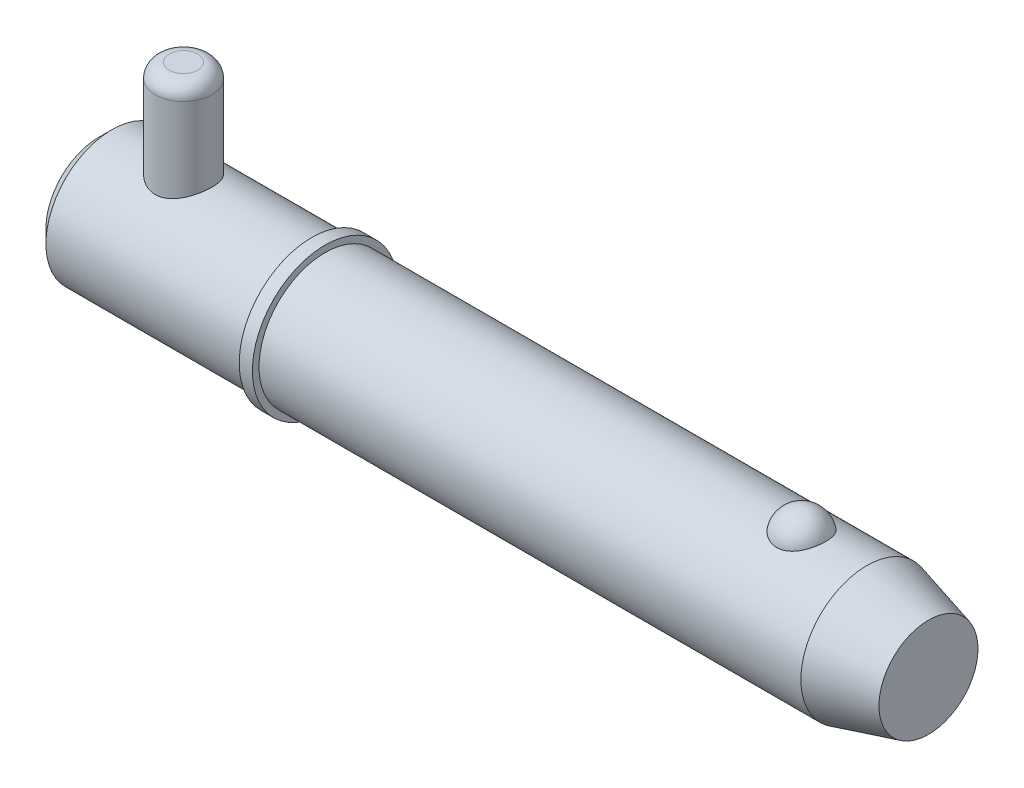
ISO-10303-21;
HEADER;
FILE_DESCRIPTION(('STEP AP214'),'2;1');
FILE_NAME('part.step','',(''),(''),'','','');
FILE_SCHEMA(('AUTOMOTIVE_DESIGN { 1 0 10303 214 1 1 1 1 }'));
ENDSEC;
DATA;
#1=APPLICATION_CONTEXT('core data for automotive mechanical design processes');
#2=APPLICATION_PROTOCOL_DEFINITION('international standard','automotive_design',2000,#1);
#3=PRODUCT_CONTEXT('',#1,'mechanical');
#4=PRODUCT('Part','Part','',(#3));
#5=PRODUCT_RELATED_PRODUCT_CATEGORY('part','',(#4));
#6=PRODUCT_DEFINITION_FORMATION('','',#4);
#7=PRODUCT_DEFINITION_CONTEXT('part definition',#1,'design');
#8=PRODUCT_DEFINITION('design','',#6,#7);
#9=PRODUCT_DEFINITION_SHAPE('','',#8);
#10=(LENGTH_UNIT() NAMED_UNIT(*) SI_UNIT(.MILLI.,.METRE.));
#11=(NAMED_UNIT(*) PLANE_ANGLE_UNIT() SI_UNIT($,.RADIAN.));
#12=(NAMED_UNIT(*) SI_UNIT($,.STERADIAN.) SOLID_ANGLE_UNIT());
#13=UNCERTAINTY_MEASURE_WITH_UNIT(LENGTH_MEASURE(1.E-05),#10,'distance_accuracy_value','');
#14=(GEOMETRIC_REPRESENTATION_CONTEXT(3) GLOBAL_UNCERTAINTY_ASSIGNED_CONTEXT((#13)) GLOBAL_UNIT_ASSIGNED_CONTEXT((#10,
#11,#12)) REPRESENTATION_CONTEXT('',''));
#15=CARTESIAN_POINT('',(0.,0.,0.));
#16=DIRECTION('',(0.,0.,1.));
#17=DIRECTION('',(1.,0.,0.));
#18=AXIS2_PLACEMENT_3D('',#15,#16,#17);
#19=CARTESIAN_POINT('',(14.28,26.985,0.));
#20=DIRECTION('',(0.,-1.,0.));
#21=DIRECTION('',(0.,0.,-1.));
#22=AXIS2_PLACEMENT_3D('',#19,#20,#21);
#23=CYLINDRICAL_SURFACE('',#22,4.76);
#24=CARTESIAN_POINT('',(14.28,-8.73500000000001,0.));
#25=DIRECTION('',(0.,1.,0.));
#26=DIRECTION('',(0.,0.,1.));
#27=AXIS2_PLACEMENT_3D('',#24,#25,#26);
#28=CIRCLE('',#27,4.76);
#29=CARTESIAN_POINT('',(14.28,-8.73500000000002,-4.76));
#30=VERTEX_POINT('',#29);
#31=EDGE_CURVE('P0_E25',#30,#30,#28,.T.);
#32=CARTESIAN_POINT('',(14.28,24.605,0.));
#33=DIRECTION('',(0.,1.,0.));
#34=DIRECTION('',(0.,0.,1.));
#35=AXIS2_PLACEMENT_3D('',#32,#33,#34);
#36=CIRCLE('',#35,4.76);
#37=CARTESIAN_POINT('',(14.28,24.605,-4.76));
#38=VERTEX_POINT('',#37);
#39=EDGE_CURVE('P0_E29',#38,#38,#36,.F.);
#40=CARTESIAN_POINT('',(14.28,-8.73500000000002,-4.76));
#41=CARTESIAN_POINT('',(14.28,-8.38770833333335,-4.76));
#42=CARTESIAN_POINT('',(14.28,-8.04041666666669,-4.76));
#43=CARTESIAN_POINT('',(14.28,-7.34583333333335,-4.76));
#44=CARTESIAN_POINT('',(14.28,-6.99854166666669,-4.76));
#45=CARTESIAN_POINT('',(14.28,-6.30395833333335,-4.76));
#46=CARTESIAN_POINT('',(14.28,-5.95666666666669,-4.76));
#47=CARTESIAN_POINT('',(14.28,-5.26208333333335,-4.76));
#48=CARTESIAN_POINT('',(14.28,-4.91479166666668,-4.76));
#49=CARTESIAN_POINT('',(14.28,-4.22020833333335,-4.76));
#50=CARTESIAN_POINT('',(14.28,-3.87291666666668,-4.76));
#51=CARTESIAN_POINT('',(14.28,-3.17833333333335,-4.76));
#52=CARTESIAN_POINT('',(14.28,-2.83104166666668,-4.76));
#53=CARTESIAN_POINT('',(14.28,-2.13645833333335,-4.76));
#54=CARTESIAN_POINT('',(14.28,-1.78916666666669,-4.76));
#55=CARTESIAN_POINT('',(14.28,-1.09458333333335,-4.76));
#56=CARTESIAN_POINT('',(14.28,-0.747291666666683,-4.76));
#57=CARTESIAN_POINT('',(14.28,-0.052708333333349,-4.76));
#58=CARTESIAN_POINT('',(14.28,0.294583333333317,-4.76));
#59=CARTESIAN_POINT('',(14.28,0.989166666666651,-4.76));
#60=CARTESIAN_POINT('',(14.28,1.33645833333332,-4.76));
#61=CARTESIAN_POINT('',(14.28,2.03104166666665,-4.76));
#62=CARTESIAN_POINT('',(14.28,2.37833333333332,-4.76));
#63=CARTESIAN_POINT('',(14.28,3.07291666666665,-4.76));
#64=CARTESIAN_POINT('',(14.28,3.42020833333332,-4.76));
#65=CARTESIAN_POINT('',(14.28,4.11479166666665,-4.76));
#66=CARTESIAN_POINT('',(14.28,4.46208333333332,-4.76));
#67=CARTESIAN_POINT('',(14.28,5.15666666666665,-4.76));
#68=CARTESIAN_POINT('',(14.28,5.50395833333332,-4.76));
#69=CARTESIAN_POINT('',(14.28,6.19854166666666,-4.76));
#70=CARTESIAN_POINT('',(14.28,6.54583333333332,-4.76));
#71=CARTESIAN_POINT('',(14.28,7.24041666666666,-4.76));
#72=CARTESIAN_POINT('',(14.28,7.58770833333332,-4.76));
#73=CARTESIAN_POINT('',(14.28,8.28229166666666,-4.76));
#74=CARTESIAN_POINT('',(14.28,8.62958333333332,-4.76));
#75=CARTESIAN_POINT('',(14.28,9.32416666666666,-4.76));
#76=CARTESIAN_POINT('',(14.28,9.67145833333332,-4.76));
#77=CARTESIAN_POINT('',(14.28,10.3660416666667,-4.76));
#78=CARTESIAN_POINT('',(14.28,10.7133333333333,-4.76));
#79=CARTESIAN_POINT('',(14.28,11.4079166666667,-4.76));
#80=CARTESIAN_POINT('',(14.28,11.7552083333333,-4.76));
#81=CARTESIAN_POINT('',(14.28,12.4497916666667,-4.76));
#82=CARTESIAN_POINT('',(14.28,12.7970833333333,-4.76));
#83=CARTESIAN_POINT('',(14.28,13.4916666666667,-4.76));
#84=CARTESIAN_POINT('',(14.28,13.8389583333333,-4.76));
#85=CARTESIAN_POINT('',(14.28,14.5335416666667,-4.76));
#86=CARTESIAN_POINT('',(14.28,14.8808333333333,-4.76));
#87=CARTESIAN_POINT('',(14.28,15.5754166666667,-4.76));
#88=CARTESIAN_POINT('',(14.28,15.9227083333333,-4.76));
#89=CARTESIAN_POINT('',(14.28,16.6172916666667,-4.76));
#90=CARTESIAN_POINT('',(14.28,16.9645833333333,-4.76));
#91=CARTESIAN_POINT('',(14.28,17.6591666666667,-4.76));
#92=CARTESIAN_POINT('',(14.28,18.0064583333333,-4.76));
#93=CARTESIAN_POINT('',(14.28,18.7010416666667,-4.76));
#94=CARTESIAN_POINT('',(14.28,19.0483333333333,-4.76));
#95=CARTESIAN_POINT('',(14.28,19.7429166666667,-4.76));
#96=CARTESIAN_POINT('',(14.28,20.0902083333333,-4.76));
#97=CARTESIAN_POINT('',(14.28,20.7847916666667,-4.76));
#98=CARTESIAN_POINT('',(14.28,21.1320833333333,-4.76));
#99=CARTESIAN_POINT('',(14.28,21.8266666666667,-4.76));
#100=CARTESIAN_POINT('',(14.28,22.1739583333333,-4.76));
#101=CARTESIAN_POINT('',(14.28,22.8685416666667,-4.76));
#102=CARTESIAN_POINT('',(14.28,23.2158333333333,-4.76));
#103=CARTESIAN_POINT('',(14.28,23.9104166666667,-4.76));
#104=CARTESIAN_POINT('',(14.28,24.2577083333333,-4.76));
#105=CARTESIAN_POINT('',(14.28,24.605,-4.76));
#106=B_SPLINE_CURVE_WITH_KNOTS('',3,(#40,#41,#42,#43,#44,#45,#46,#47,#48,#49,#50,#51,#52,#53,
#54,#55,#56,#57,#58,#59,#60,#61,#62,#63,#64,#65,#66,#67,#68,#69,#70,#71,#72,#73,#74,#75,#76,#77,
#78,#79,#80,#81,#82,#83,#84,#85,#86,#87,#88,#89,#90,#91,#92,#93,#94,#95,#96,#97,#98,#99,#100,
#101,#102,#103,#104,#105),.UNSPECIFIED.,.F.,.F.,(4,2,2,2,2,2,2,2,2,2,2,2,2,2,2,2,2,2,2,2,2,2,2,
2,2,2,2,2,2,2,2,2,4),(0.,1.041875,2.08375,3.125625,4.1675,5.209375,6.25125,7.293125,
8.33500000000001,9.376875,10.41875,11.460625,12.5025,13.544375,14.58625,15.628125,16.67,
17.711875,18.75375,19.795625,20.8375,21.879375,22.92125,23.963125,25.005,26.046875,27.08875,
28.130625,29.1725,30.214375,31.25625,32.298125,33.34),.UNSPECIFIED.);
#107=EDGE_CURVE('P0_BSEAM14',#30,#38,#106,.T.);
#108=ORIENTED_EDGE('',*,*,#31,.T.);
#109=ORIENTED_EDGE('',*,*,#39,.T.);
#110=ORIENTED_EDGE('',*,*,#107,.T.);
#111=ORIENTED_EDGE('',*,*,#107,.F.);
#112=EDGE_LOOP('',(#108,#110,#109,#111));
#113=FACE_BOUND('',#112,.T.);
#114=ADVANCED_FACE('P0_F14',(#113),#23,.T.);
#115=CARTESIAN_POINT('',(14.28,26.985,0.));
#116=DIRECTION('',(0.,1.,0.));
#117=DIRECTION('',(0.,0.,1.));
#118=AXIS2_PLACEMENT_3D('',#115,#116,#117);
#119=PLANE('',#118);
#120=CARTESIAN_POINT('',(14.28,26.985,0.));
#121=DIRECTION('',(0.,1.,0.));
#122=DIRECTION('',(0.,0.,1.));
#123=AXIS2_PLACEMENT_3D('',#120,#121,#122);
#124=CIRCLE('',#123,2.38);
#125=CARTESIAN_POINT('',(14.28,26.985,2.38));
#126=VERTEX_POINT('',#125);
#127=EDGE_CURVE('P0_E10',#126,#126,#124,.T.);
#128=ORIENTED_EDGE('',*,*,#127,.T.);
#129=EDGE_LOOP('',(#128));
#130=FACE_BOUND('',#129,.T.);
#131=ADVANCED_FACE('P0_F46',(#130),#119,.T.);
#132=CARTESIAN_POINT('',(14.28,-11.115,0.));
#133=DIRECTION('',(0.,1.,0.));
#134=DIRECTION('',(0.,0.,1.));
#135=AXIS2_PLACEMENT_3D('',#132,#133,#134);
#136=PLANE('',#135);
#137=CARTESIAN_POINT('',(14.28,-11.115,0.));
#138=DIRECTION('',(0.,1.,0.));
#139=DIRECTION('',(0.,0.,1.));
#140=AXIS2_PLACEMENT_3D('',#137,#138,#139);
#141=CIRCLE('',#140,2.38);
#142=CARTESIAN_POINT('',(14.28,-11.115,2.38));
#143=VERTEX_POINT('',#142);
#144=EDGE_CURVE('P0_E21',#143,#143,#141,.F.);
#145=ORIENTED_EDGE('',*,*,#144,.T.);
#146=EDGE_LOOP('',(#145));
#147=FACE_BOUND('',#146,.T.);
#148=ADVANCED_FACE('P0_F43',(#147),#136,.F.);
#149=CARTESIAN_POINT('',(14.28,-8.735,0.));
#150=DIRECTION('',(0.,1.,0.));
#151=DIRECTION('',(0.,0.,1.));
#152=AXIS2_PLACEMENT_3D('',#149,#150,#151);
#153=DEGENERATE_TOROIDAL_SURFACE('',#152,2.38,2.38,.T.);
#154=ORIENTED_EDGE('',*,*,#144,.F.);
#155=EDGE_LOOP('',(#154));
#156=FACE_BOUND('',#155,.T.);
#157=ORIENTED_EDGE('',*,*,#31,.F.);
#158=EDGE_LOOP('',(#157));
#159=FACE_BOUND('',#158,.T.);
#160=ADVANCED_FACE('P0_F38',(#156,#159),#153,.T.);
#161=CARTESIAN_POINT('',(14.28,24.605,0.));
#162=DIRECTION('',(0.,1.,0.));
#163=DIRECTION('',(0.,0.,1.));
#164=AXIS2_PLACEMENT_3D('',#161,#162,#163);
#165=DEGENERATE_TOROIDAL_SURFACE('',#164,2.38,2.38,.T.);
#166=ORIENTED_EDGE('',*,*,#39,.F.);
#167=EDGE_LOOP('',(#166));
#168=FACE_BOUND('',#167,.T.);
#169=ORIENTED_EDGE('',*,*,#127,.F.);
#170=EDGE_LOOP('',(#169));
#171=FACE_BOUND('',#170,.T.);
#172=ADVANCED_FACE('P0_F16',(#168,#171),#165,.T.);
#173=CLOSED_SHELL('',(#114,#131,#148,#160,#172));
#174=MANIFOLD_SOLID_BREP('P0_B1',#173);
#175=CARTESIAN_POINT('',(0.,0.,0.));
#176=DIRECTION('',(1.,0.,0.));
#177=DIRECTION('',(0.,0.,-1.));
#178=AXIS2_PLACEMENT_3D('',#175,#176,#177);
#179=CYLINDRICAL_SURFACE('',#178,11.115);
#180=CARTESIAN_POINT('',(129.329563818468,0.,0.));
#181=DIRECTION('',(1.,0.,0.));
#182=DIRECTION('',(0.,0.,-1.));
#183=AXIS2_PLACEMENT_3D('',#180,#181,#182);
#184=CIRCLE('',#183,11.115);
#185=CARTESIAN_POINT('',(129.329563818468,0.,-11.115));
#186=VERTEX_POINT('',#185);
#187=EDGE_CURVE('P1_E81',#186,#186,#184,.T.);
#188=ORIENTED_EDGE('',*,*,#187,.F.);
#189=EDGE_LOOP('',(#188));
#190=FACE_BOUND('',#189,.T.);
#191=CARTESIAN_POINT('',(38.1,0.,0.));
#192=DIRECTION('',(1.,0.,0.));
#193=DIRECTION('',(0.,0.,-1.));
#194=AXIS2_PLACEMENT_3D('',#191,#192,#193);
#195=CIRCLE('',#194,11.115);
#196=CARTESIAN_POINT('',(38.1,0.,-11.115));
#197=VERTEX_POINT('',#196);
#198=EDGE_CURVE('P1_E85',#197,#197,#195,.T.);
#199=ORIENTED_EDGE('',*,*,#198,.T.);
#200=EDGE_LOOP('',(#199));
#201=FACE_BOUND('',#200,.T.);
#202=CARTESIAN_POINT('',(118.331068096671,10.3028087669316,4.17077409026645));
#203=CARTESIAN_POINT('',(118.114775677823,10.3028003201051,4.17078240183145));
#204=CARTESIAN_POINT('',(117.898548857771,10.3098895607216,4.15340593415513));
#205=CARTESIAN_POINT('',(117.472540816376,10.3373834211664,4.08449540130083));
#206=CARTESIAN_POINT('',(117.262757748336,10.3577841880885,4.0329712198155));
#207=CARTESIAN_POINT('',(116.855782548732,10.4095237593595,3.89746513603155));
#208=CARTESIAN_POINT('',(116.658572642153,10.4408466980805,3.81353029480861));
#209=CARTESIAN_POINT('',(116.281338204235,10.5110236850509,3.61560339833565));
#210=CARTESIAN_POINT('',(116.101317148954,10.5498792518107,3.50160528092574));
#211=CARTESIAN_POINT('',(115.757684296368,10.6322884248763,3.24292464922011));
#212=CARTESIAN_POINT('',(115.594686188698,10.6759443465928,3.09746040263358));
#213=CARTESIAN_POINT('',(115.294591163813,10.7625291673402,2.78171925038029));
#214=CARTESIAN_POINT('',(115.157499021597,10.8054579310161,2.61143778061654));
#215=CARTESIAN_POINT('',(114.906408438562,10.8881935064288,2.24226695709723));
#216=CARTESIAN_POINT('',(114.793710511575,10.9277761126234,2.04244123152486));
#217=CARTESIAN_POINT('',(114.601777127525,10.997484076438,1.62578254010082));
#218=CARTESIAN_POINT('',(114.522544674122,11.0276085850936,1.40894804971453));
#219=CARTESIAN_POINT('',(114.398303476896,11.0756732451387,0.961250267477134));
#220=CARTESIAN_POINT('',(114.353760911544,11.0934470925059,0.730239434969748));
#221=CARTESIAN_POINT('',(114.301569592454,11.1143331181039,0.263439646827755));
#222=CARTESIAN_POINT('',(114.293920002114,11.1174456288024,0.0276507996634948));
#223=CARTESIAN_POINT('',(114.31561056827,11.1087161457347,-0.440729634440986));
#224=CARTESIAN_POINT('',(114.344762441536,11.0969502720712,-0.673331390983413));
#225=CARTESIAN_POINT('',(114.439143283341,11.0597872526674,-1.12996621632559));
#226=CARTESIAN_POINT('',(114.504372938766,11.0343898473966,-1.35399912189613));
#227=CARTESIAN_POINT('',(114.66969844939,10.972515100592,-1.78750286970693));
#228=CARTESIAN_POINT('',(114.76983863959,10.9360236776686,-1.99695478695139));
#229=CARTESIAN_POINT('',(115.002940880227,10.8557595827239,-2.39520667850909));
#230=CARTESIAN_POINT('',(115.135905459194,10.8119863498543,-2.5840050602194));
#231=CARTESIAN_POINT('',(115.432407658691,10.7216733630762,-2.93635726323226));
#232=CARTESIAN_POINT('',(115.596056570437,10.675123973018,-3.09981510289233));
#233=CARTESIAN_POINT('',(115.949860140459,10.5846571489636,-3.39592247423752));
#234=CARTESIAN_POINT('',(116.140012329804,10.5407394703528,-3.52857487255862));
#235=CARTESIAN_POINT('',(116.53750141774,10.4616690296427,-3.75646057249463));
#236=CARTESIAN_POINT('',(116.74436705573,10.4263443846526,-3.8524543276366));
#237=CARTESIAN_POINT('',(117.172954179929,10.3675574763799,-4.00798747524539));
#238=CARTESIAN_POINT('',(117.394670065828,10.344090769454,-4.0675405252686));
#239=CARTESIAN_POINT('',(117.834669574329,10.3128282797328,-4.14614314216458));
#240=CARTESIAN_POINT('',(118.052565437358,10.3043040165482,-4.1670783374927));
#241=CARTESIAN_POINT('',(118.48894951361,10.3016771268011,-4.17357158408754));
#242=CARTESIAN_POINT('',(118.707437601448,10.3075716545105,-4.15913661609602));
#243=CARTESIAN_POINT('',(119.131744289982,10.3326686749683,-4.09636961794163));
#244=CARTESIAN_POINT('',(119.337745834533,10.3514555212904,-4.0490957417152));
#245=CARTESIAN_POINT('',(119.738576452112,10.399818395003,-3.92320197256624));
#246=CARTESIAN_POINT('',(119.9334046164,10.4293952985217,-3.84457953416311));
#247=CARTESIAN_POINT('',(120.311191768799,10.4969600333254,-3.65612410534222));
#248=CARTESIAN_POINT('',(120.493797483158,10.5351178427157,-3.54564545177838));
#249=CARTESIAN_POINT('',(120.838204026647,10.6154999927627,-3.29718036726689));
#250=CARTESIAN_POINT('',(121.000000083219,10.657725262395,-3.15918764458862));
#251=CARTESIAN_POINT('',(121.306959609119,10.744212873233,-2.85163580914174));
#252=CARTESIAN_POINT('',(121.450891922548,10.7884718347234,-2.68084605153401));
#253=CARTESIAN_POINT('',(121.709237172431,10.872374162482,-2.3172186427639));
#254=CARTESIAN_POINT('',(121.823644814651,10.9120167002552,-2.12437704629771));
#255=CARTESIAN_POINT('',(122.023873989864,10.9838919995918,-1.71516999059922));
#256=CARTESIAN_POINT('',(122.10866178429,11.0158465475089,-1.498248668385));
#257=CARTESIAN_POINT('',(122.24268382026,11.0673523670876,-1.052285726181));
#258=CARTESIAN_POINT('',(122.291917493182,11.086903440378,-0.823243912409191));
#259=CARTESIAN_POINT('',(122.353891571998,11.1116323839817,-0.359087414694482));
#260=CARTESIAN_POINT('',(122.366566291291,11.1167843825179,-0.123962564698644));
#261=CARTESIAN_POINT('',(122.354973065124,11.1121144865,0.345220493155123));
#262=CARTESIAN_POINT('',(122.330705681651,11.1022928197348,0.579278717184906));
#263=CARTESIAN_POINT('',(122.245907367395,11.0687504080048,1.03866534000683));
#264=CARTESIAN_POINT('',(122.185529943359,11.0450885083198,1.26402641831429));
#265=CARTESIAN_POINT('',(122.029853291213,10.9863185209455,1.70076772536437));
#266=CARTESIAN_POINT('',(121.934551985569,10.9512097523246,1.91214712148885));
#267=CARTESIAN_POINT('',(121.710397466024,10.8729733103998,2.31608359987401));
#268=CARTESIAN_POINT('',(121.581380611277,10.8298068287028,2.50854240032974));
#269=CARTESIAN_POINT('',(121.292732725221,10.7401896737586,2.86808766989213));
#270=CARTESIAN_POINT('',(121.133102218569,10.6937390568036,3.03517457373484));
#271=CARTESIAN_POINT('',(120.787534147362,10.6029321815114,3.33857581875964));
#272=CARTESIAN_POINT('',(120.601708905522,10.5585680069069,3.47501541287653));
#273=CARTESIAN_POINT('',(120.207875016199,10.4769321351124,3.71390897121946));
#274=CARTESIAN_POINT('',(119.999863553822,10.439661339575,3.81635861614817));
#275=CARTESIAN_POINT('',(119.554066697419,10.3749407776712,3.98910631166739));
#276=CARTESIAN_POINT('',(119.315234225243,10.3482457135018,4.05700929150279));
#277=CARTESIAN_POINT('',(118.827925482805,10.312188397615,4.14782844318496));
#278=CARTESIAN_POINT('',(118.579453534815,10.3028184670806,4.17076454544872));
#279=CARTESIAN_POINT('',(118.331068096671,10.3028087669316,4.17077409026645));
#280=B_SPLINE_CURVE_WITH_KNOTS('',3,(#202,#203,#204,#205,#206,#207,#208,#209,#210,#211,#212,
#213,#214,#215,#216,#217,#218,#219,#220,#221,#222,#223,#224,#225,#226,#227,#228,#229,#230,#231,
#232,#233,#234,#235,#236,#237,#238,#239,#240,#241,#242,#243,#244,#245,#246,#247,#248,#249,#250,
#251,#252,#253,#254,#255,#256,#257,#258,#259,#260,#261,#262,#263,#264,#265,#266,#267,#268,#269,
#270,#271,#272,#273,#274,#275,#276,#277,#278,#279),.UNSPECIFIED.,.T.,.F.,(4,2,2,2,2,2,2,2,2,2,2,
2,2,2,2,2,2,2,2,2,2,2,2,2,2,2,2,2,2,2,2,2,2,2,2,2,2,2,4),(0.,0.647966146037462,1.29574482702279,
1.94258643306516,2.58955857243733,3.25496465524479,3.92049326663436,4.61566368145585,
5.3108964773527,6.01531821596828,6.71972398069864,7.42054043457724,8.12137023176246,
8.82309331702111,9.52487047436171,10.2292439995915,10.9335519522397,11.6223330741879,
12.3108558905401,12.9647664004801,13.6185478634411,14.2521847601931,14.8858731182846,
15.5334360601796,16.1811472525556,16.8611459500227,17.5412664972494,18.2431855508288,
18.9451158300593,19.6483065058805,20.3514864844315,21.0516982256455,21.7519516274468,
22.4556690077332,23.1593743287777,23.8601491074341,24.5610129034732,25.3054529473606,
26.049562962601),.UNSPECIFIED.);
#281=CARTESIAN_POINT('',(118.331068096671,10.3028087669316,4.17077409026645));
#282=VERTEX_POINT('',#281);
#283=EDGE_CURVE('P1_E35',#282,#282,#280,.T.);
#284=ORIENTED_EDGE('',*,*,#283,.T.);
#285=EDGE_LOOP('',(#284));
#286=FACE_BOUND('',#285,.T.);
#287=ADVANCED_FACE('P1_F13',(#190,#201,#286),#179,.T.);
#288=CARTESIAN_POINT('',(0.,0.,0.));
#289=DIRECTION('',(-1.,0.,0.));
#290=DIRECTION('',(0.,0.,1.));
#291=AXIS2_PLACEMENT_3D('',#288,#289,#290);
#292=PLANE('',#291);
#293=CARTESIAN_POINT('',(0.,0.,0.));
#294=DIRECTION('',(1.,0.,0.));
#295=DIRECTION('',(0.,0.,-1.));
#296=AXIS2_PLACEMENT_3D('',#293,#294,#295);
#297=CIRCLE('',#296,8.892);
#298=CARTESIAN_POINT('',(0.,0.,-8.892));
#299=VERTEX_POINT('',#298);
#300=EDGE_CURVE('P1_E9',#299,#299,#297,.T.);
#301=ORIENTED_EDGE('',*,*,#300,.F.);
#302=EDGE_LOOP('',(#301));
#303=FACE_BOUND('',#302,.T.);
#304=ADVANCED_FACE('P1_F15',(#303),#292,.T.);
#305=CARTESIAN_POINT('',(2.22299999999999,0.,0.));
#306=DIRECTION('',(1.,0.,0.));
#307=DIRECTION('',(0.,0.,-1.));
#308=AXIS2_PLACEMENT_3D('',#305,#306,#307);
#309=CONICAL_SURFACE('',#308,11.115,0.78539816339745);
#310=ORIENTED_EDGE('',*,*,#300,.T.);
#311=EDGE_LOOP('',(#310));
#312=FACE_BOUND('',#311,.T.);
#313=CARTESIAN_POINT('',(2.22299999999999,0.,0.));
#314=DIRECTION('',(1.,0.,0.));
#315=DIRECTION('',(0.,0.,-1.));
#316=AXIS2_PLACEMENT_3D('',#313,#314,#315);
#317=CIRCLE('',#316,11.115);
#318=CARTESIAN_POINT('',(2.22299999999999,0.,-11.115));
#319=VERTEX_POINT('',#318);
#320=EDGE_CURVE('P1_E26',#319,#319,#317,.T.);
#321=ORIENTED_EDGE('',*,*,#320,.F.);
#322=EDGE_LOOP('',(#321));
#323=FACE_BOUND('',#322,.T.);
#324=ADVANCED_FACE('P1_F77',(#312,#323),#309,.T.);
#325=CARTESIAN_POINT('',(0.,0.,0.));
#326=DIRECTION('',(1.,0.,0.));
#327=DIRECTION('',(0.,0.,-1.));
#328=AXIS2_PLACEMENT_3D('',#325,#326,#327);
#329=CYLINDRICAL_SURFACE('',#328,11.115);
#330=CARTESIAN_POINT('',(14.28,-10.0441836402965,4.76));
#331=CARTESIAN_POINT('',(14.1533731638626,-10.0441846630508,4.75999904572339));
#332=CARTESIAN_POINT('',(14.0267055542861,-10.0465865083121,4.75493985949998));
#333=CARTESIAN_POINT('',(13.774298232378,-10.0561141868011,4.73475585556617));
#334=CARTESIAN_POINT('',(13.6485591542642,-10.0632429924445,4.71962470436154));
#335=CARTESIAN_POINT('',(13.3987500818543,-10.0819979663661,4.67942666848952));
#336=CARTESIAN_POINT('',(13.2746840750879,-10.0936334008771,4.65433930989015));
#337=CARTESIAN_POINT('',(13.0293244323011,-10.1210146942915,4.59449317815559));
#338=CARTESIAN_POINT('',(12.9080319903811,-10.1367622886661,4.55973032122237));
#339=CARTESIAN_POINT('',(12.669614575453,-10.1717810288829,4.48106435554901));
#340=CARTESIAN_POINT('',(12.5524727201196,-10.1910352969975,4.4372048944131));
#341=CARTESIAN_POINT('',(12.3224300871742,-10.2325403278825,4.34063417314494));
#342=CARTESIAN_POINT('',(12.2095309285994,-10.2547922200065,4.28791957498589));
#343=CARTESIAN_POINT('',(11.8782785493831,-10.3250879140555,4.11715127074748));
#344=CARTESIAN_POINT('',(11.6670799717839,-10.3767168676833,3.98637638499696));
#345=CARTESIAN_POINT('',(11.2564039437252,-10.4874309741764,3.68567149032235));
#346=CARTESIAN_POINT('',(11.0583793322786,-10.5467772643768,3.51386978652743));
#347=CARTESIAN_POINT('',(10.6927724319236,-10.6641377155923,3.13969960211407));
#348=CARTESIAN_POINT('',(10.5252022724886,-10.7221513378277,2.93731900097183));
#349=CARTESIAN_POINT('',(10.2965609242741,-10.8050020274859,2.60935726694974));
#350=CARTESIAN_POINT('',(10.2227768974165,-10.8324811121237,2.49310321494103));
#351=CARTESIAN_POINT('',(10.0853380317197,-10.884703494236,2.25418999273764));
#352=CARTESIAN_POINT('',(10.0216789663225,-10.9094479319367,2.13153352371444));
#353=CARTESIAN_POINT('',(9.90506238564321,-10.9554932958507,1.88060370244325));
#354=CARTESIAN_POINT('',(9.85210574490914,-10.9767939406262,1.7523298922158));
#355=CARTESIAN_POINT('',(9.75746464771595,-11.0153112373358,1.49115740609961));
#356=CARTESIAN_POINT('',(9.71577447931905,-11.0325299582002,1.35826111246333));
#357=CARTESIAN_POINT('',(9.64605475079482,-11.0615607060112,1.09614539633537));
#358=CARTESIAN_POINT('',(9.61740732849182,-11.0736151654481,0.96711700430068));
#359=CARTESIAN_POINT('',(9.57092026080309,-11.0932687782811,0.706847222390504));
#360=CARTESIAN_POINT('',(9.55307574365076,-11.1008699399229,0.575606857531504));
#361=CARTESIAN_POINT('',(9.52838640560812,-11.1114054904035,0.31192917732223));
#362=CARTESIAN_POINT('',(9.52153986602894,-11.114340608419,0.179492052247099));
#363=CARTESIAN_POINT('',(9.51892405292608,-11.1154607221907,-0.0855090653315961));
#364=CARTESIAN_POINT('',(9.52315432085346,-11.1136459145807,-0.218073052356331));
#365=CARTESIAN_POINT('',(9.542009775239,-11.1055891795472,-0.473709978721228));
#366=CARTESIAN_POINT('',(9.55594693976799,-11.099640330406,-0.596843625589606));
#367=CARTESIAN_POINT('',(9.59332832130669,-11.0837823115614,-0.841440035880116));
#368=CARTESIAN_POINT('',(9.61677567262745,-11.0738718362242,-0.962902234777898));
#369=CARTESIAN_POINT('',(9.67294089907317,-11.0503378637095,-1.20325684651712));
#370=CARTESIAN_POINT('',(9.70565569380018,-11.0367156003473,-1.32215009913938));
#371=CARTESIAN_POINT('',(9.78005008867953,-11.0060908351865,-1.55666640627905));
#372=CARTESIAN_POINT('',(9.82173311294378,-10.9890870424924,-1.67228819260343));
#373=CARTESIAN_POINT('',(9.96110379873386,-10.9330280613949,-2.01656166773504));
#374=CARTESIAN_POINT('',(10.0722987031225,-10.8892801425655,-2.23915547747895));
#375=CARTESIAN_POINT('',(10.3268588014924,-10.7934745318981,-2.66299199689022));
#376=CARTESIAN_POINT('',(10.4702355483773,-10.7414138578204,-2.86422700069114));
#377=CARTESIAN_POINT('',(10.7973904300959,-10.6296201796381,-3.25557775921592));
#378=CARTESIAN_POINT('',(10.9833705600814,-10.569604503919,-3.443774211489));
#379=CARTESIAN_POINT('',(11.3844486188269,-10.4514707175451,-3.78722133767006));
#380=CARTESIAN_POINT('',(11.5995590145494,-10.3933534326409,-3.94245783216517));
#381=CARTESIAN_POINT('',(11.9444340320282,-10.311516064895,-4.14990014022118));
#382=CARTESIAN_POINT('',(12.0654579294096,-10.2847012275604,-4.21573894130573));
#383=CARTESIAN_POINT('',(12.3132718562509,-10.2342051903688,-4.33688518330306));
#384=CARTESIAN_POINT('',(12.4400593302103,-10.2105226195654,-4.39219723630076));
#385=CARTESIAN_POINT('',(12.6985418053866,-10.1671237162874,-4.49174500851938));
#386=CARTESIAN_POINT('',(12.8302359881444,-10.1474067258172,-4.53598256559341));
#387=CARTESIAN_POINT('',(13.0975061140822,-10.1126841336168,-4.61287629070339));
#388=CARTESIAN_POINT('',(13.233079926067,-10.0976759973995,-4.64553869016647));
#389=CARTESIAN_POINT('',(13.4978553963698,-10.0737863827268,-4.6971059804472));
#390=CARTESIAN_POINT('',(13.6268754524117,-10.0645618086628,-4.716785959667));
#391=CARTESIAN_POINT('',(13.8862990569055,-10.051062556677,-4.74548419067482));
#392=CARTESIAN_POINT('',(14.0167019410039,-10.0467856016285,-4.75450734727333));
#393=CARTESIAN_POINT('',(14.277859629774,-10.0433352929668,-4.76179143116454));
#394=CARTESIAN_POINT('',(14.4086143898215,-10.0441613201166,-4.76005366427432));
#395=CARTESIAN_POINT('',(14.6694025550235,-10.0508838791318,-4.74584231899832));
#396=CARTESIAN_POINT('',(14.7994359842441,-10.0567802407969,-4.73336910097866));
#397=CARTESIAN_POINT('',(15.0487369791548,-10.0728449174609,-4.69907984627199));
#398=CARTESIAN_POINT('',(15.1681238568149,-10.0826872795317,-4.67797462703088));
#399=CARTESIAN_POINT('',(15.4045894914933,-10.1062580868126,-4.62682977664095));
#400=CARTESIAN_POINT('',(15.5216674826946,-10.1199877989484,-4.59678723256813));
#401=CARTESIAN_POINT('',(15.868278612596,-10.1664161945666,-4.49365911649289));
#402=CARTESIAN_POINT('',(16.0933756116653,-10.2043671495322,-4.40754694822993));
#403=CARTESIAN_POINT('',(16.5357981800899,-10.2919879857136,-4.19898201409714));
#404=CARTESIAN_POINT('',(16.7523611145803,-10.3420954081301,-4.07511281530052));
#405=CARTESIAN_POINT('',(17.1627188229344,-10.4477911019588,-3.7959429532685));
#406=CARTESIAN_POINT('',(17.3565033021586,-10.5033818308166,-3.64062816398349));
#407=CARTESIAN_POINT('',(17.7334034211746,-10.6196376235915,-3.28693729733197));
#408=CARTESIAN_POINT('',(17.9141276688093,-10.6803237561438,-3.08599175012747));
#409=CARTESIAN_POINT('',(18.1582189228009,-10.7666348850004,-2.76320365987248));
#410=CARTESIAN_POINT('',(18.2351223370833,-10.7946346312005,-2.65197124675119));
#411=CARTESIAN_POINT('',(18.3793967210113,-10.8483267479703,-2.42297927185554));
#412=CARTESIAN_POINT('',(18.4467718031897,-10.87402011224,-2.30522255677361));
#413=CARTESIAN_POINT('',(18.5717669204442,-10.9225249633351,-2.06324665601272));
#414=CARTESIAN_POINT('',(18.6293326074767,-10.9453202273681,-1.93899615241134));
#415=CARTESIAN_POINT('',(18.73370006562,-10.9872100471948,-1.6855059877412));
#416=CARTESIAN_POINT('',(18.7805065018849,-11.0063062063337,-1.55626851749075));
#417=CARTESIAN_POINT('',(18.8628731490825,-11.0402419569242,-1.29375150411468));
#418=CARTESIAN_POINT('',(18.8984366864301,-11.0550828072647,-1.16047316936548));
#419=CARTESIAN_POINT('',(18.9579183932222,-11.0800638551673,-0.890912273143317));
#420=CARTESIAN_POINT('',(18.9818374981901,-11.0902044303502,-0.75462995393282));
#421=CARTESIAN_POINT('',(19.0164177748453,-11.104911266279,-0.490295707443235));
#422=CARTESIAN_POINT('',(19.027922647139,-11.1098318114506,-0.362373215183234));
#423=CARTESIAN_POINT('',(19.040554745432,-11.1152360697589,-0.105876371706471));
#424=CARTESIAN_POINT('',(19.0416784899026,-11.1157182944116,0.0226981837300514));
#425=CARTESIAN_POINT('',(19.0335275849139,-11.1122291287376,0.27938352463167));
#426=CARTESIAN_POINT('',(19.0242587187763,-11.1082602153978,0.407494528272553));
#427=CARTESIAN_POINT('',(18.9954320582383,-11.0959792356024,0.662388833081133));
#428=CARTESIAN_POINT('',(18.9758704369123,-11.0876655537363,0.789171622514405));
#429=CARTESIAN_POINT('',(18.9276379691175,-11.0673259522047,1.03545890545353));
#430=CARTESIAN_POINT('',(18.8993573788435,-11.0554596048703,1.15505309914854));
#431=CARTESIAN_POINT('',(18.8337694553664,-11.0282166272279,1.39134516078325));
#432=CARTESIAN_POINT('',(18.7964589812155,-11.0128387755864,1.5080420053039));
#433=CARTESIAN_POINT('',(18.671464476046,-10.9619666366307,1.85262797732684));
#434=CARTESIAN_POINT('',(18.5706772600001,-10.9217161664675,2.07521484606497));
#435=CARTESIAN_POINT('',(18.33202463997,-10.8301378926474,2.51061719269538));
#436=CARTESIAN_POINT('',(18.1926775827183,-10.7783885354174,2.72252375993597));
#437=CARTESIAN_POINT('',(17.8829747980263,-10.669863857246,3.12088015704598));
#438=CARTESIAN_POINT('',(17.7126068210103,-10.6130865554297,3.30731987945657));
#439=CARTESIAN_POINT('',(17.3310036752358,-10.495668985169,3.66358491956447));
#440=CARTESIAN_POINT('',(17.1177010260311,-10.4350471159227,3.83122543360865));
#441=CARTESIAN_POINT('',(16.7778915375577,-10.3495418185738,4.05420569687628));
#442=CARTESIAN_POINT('',(16.6612023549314,-10.3219229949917,4.12383380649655));
#443=CARTESIAN_POINT('',(16.4218466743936,-10.2693487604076,4.25306463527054));
#444=CARTESIAN_POINT('',(16.2991829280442,-10.2443921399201,4.31267191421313));
#445=CARTESIAN_POINT('',(16.0488008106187,-10.1979981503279,4.42126071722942));
#446=CARTESIAN_POINT('',(15.9210894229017,-10.1765561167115,4.47025635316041));
#447=CARTESIAN_POINT('',(15.6613937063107,-10.1379191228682,4.55720152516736));
#448=CARTESIAN_POINT('',(15.5294115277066,-10.1207220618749,4.59515652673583));
#449=CARTESIAN_POINT('',(15.2624981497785,-10.091252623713,4.65951684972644));
#450=CARTESIAN_POINT('',(15.1275757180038,-10.0789672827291,4.68595259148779));
#451=CARTESIAN_POINT('',(14.8556442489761,-10.0597530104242,4.72706206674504));
#452=CARTESIAN_POINT('',(14.7186368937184,-10.0528199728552,4.74174481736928));
#453=CARTESIAN_POINT('',(14.5310955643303,-10.047196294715,4.75363843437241));
#454=CARTESIAN_POINT('',(14.48091543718,-10.0460674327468,4.75602323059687));
#455=CARTESIAN_POINT('',(14.3804923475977,-10.044560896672,4.7592042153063));
#456=CARTESIAN_POINT('',(14.3302493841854,-10.0441832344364,4.76000037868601));
#457=CARTESIAN_POINT('',(14.28,-10.0441836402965,4.76));
#458=B_SPLINE_CURVE_WITH_KNOTS('',3,(#330,#331,#332,#333,#334,#335,#336,#337,#338,#339,#340,
#341,#342,#343,#344,#345,#346,#347,#348,#349,#350,#351,#352,#353,#354,#355,#356,#357,#358,#359,
#360,#361,#362,#363,#364,#365,#366,#367,#368,#369,#370,#371,#372,#373,#374,#375,#376,#377,#378,
#379,#380,#381,#382,#383,#384,#385,#386,#387,#388,#389,#390,#391,#392,#393,#394,#395,#396,#397,
#398,#399,#400,#401,#402,#403,#404,#405,#406,#407,#408,#409,#410,#411,#412,#413,#414,#415,#416,
#417,#418,#419,#420,#421,#422,#423,#424,#425,#426,#427,#428,#429,#430,#431,#432,#433,#434,#435,
#436,#437,#438,#439,#440,#441,#442,#443,#444,#445,#446,#447,#448,#449,#450,#451,#452,#453,#454,
#455,#456,#457),.UNSPECIFIED.,.T.,.F.,(4,2,2,2,2,2,2,2,2,2,2,2,2,2,2,2,2,2,2,2,2,2,2,2,2,2,2,2,
2,2,2,2,2,2,2,2,2,2,2,2,2,2,2,2,2,2,2,2,2,2,2,2,2,2,2,2,2,2,2,2,2,2,2,4),(0.,0.379828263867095,
0.759895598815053,1.14074858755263,1.52176256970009,1.90098898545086,2.28035867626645,
3.03818035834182,3.84125131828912,4.6446414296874,5.06541657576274,5.48601561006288,
5.90664899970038,6.3270687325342,6.72470503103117,7.12216187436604,7.51955659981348,
7.91693487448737,8.28868404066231,8.66055582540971,9.03230414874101,9.40419465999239,
10.1585834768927,10.9132435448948,11.7236471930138,12.5343987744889,12.9550196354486,
13.3754557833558,13.7958221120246,14.2159617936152,14.6079540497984,14.9997658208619,
15.3915300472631,15.7832811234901,16.1477615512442,16.512360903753,17.240999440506,
18.0012974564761,18.761937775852,19.5886929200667,20.0025782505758,20.4162843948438,
20.832212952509,21.2479608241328,21.6635855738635,22.0791769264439,22.4642880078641,
22.8495282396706,23.2345541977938,23.6197234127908,23.9896813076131,24.3597680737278,
25.099327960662,25.8726239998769,26.6462260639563,27.4759193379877,27.8914891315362,
28.3068693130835,28.7216936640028,29.1363123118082,29.5498292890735,29.9630287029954,
30.113753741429,30.2644811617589),.UNSPECIFIED.);
#459=CARTESIAN_POINT('',(14.28,-10.0441836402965,4.76));
#460=VERTEX_POINT('',#459);
#461=EDGE_CURVE('P1_E17',#460,#460,#458,.T.);
#462=ORIENTED_EDGE('',*,*,#461,.F.);
#463=EDGE_LOOP('',(#462));
#464=FACE_BOUND('',#463,.T.);
#465=CARTESIAN_POINT('',(14.28,10.0441836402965,4.76));
#466=CARTESIAN_POINT('',(14.4066268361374,10.0441846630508,4.75999904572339));
#467=CARTESIAN_POINT('',(14.5332944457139,10.0465865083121,4.75493985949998));
#468=CARTESIAN_POINT('',(14.785701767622,10.0561141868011,4.73475585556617));
#469=CARTESIAN_POINT('',(14.9114408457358,10.0632429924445,4.71962470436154));
#470=CARTESIAN_POINT('',(15.1612499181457,10.0819979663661,4.67942666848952));
#471=CARTESIAN_POINT('',(15.2853159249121,10.0936334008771,4.65433930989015));
#472=CARTESIAN_POINT('',(15.5306755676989,10.1210146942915,4.59449317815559));
#473=CARTESIAN_POINT('',(15.6519680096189,10.1367622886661,4.55973032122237));
#474=CARTESIAN_POINT('',(15.890385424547,10.1717810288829,4.48106435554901));
#475=CARTESIAN_POINT('',(16.0075272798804,10.1910352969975,4.4372048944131));
#476=CARTESIAN_POINT('',(16.2375699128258,10.2325403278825,4.34063417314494));
#477=CARTESIAN_POINT('',(16.3504690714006,10.2547922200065,4.28791957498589));
#478=CARTESIAN_POINT('',(16.6817214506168,10.3250879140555,4.11715127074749));
#479=CARTESIAN_POINT('',(16.8929200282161,10.3767168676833,3.98637638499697));
#480=CARTESIAN_POINT('',(17.3035960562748,10.4874309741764,3.68567149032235));
#481=CARTESIAN_POINT('',(17.5016206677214,10.5467772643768,3.51386978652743));
#482=CARTESIAN_POINT('',(17.8672275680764,10.6641377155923,3.13969960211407));
#483=CARTESIAN_POINT('',(18.0347977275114,10.7221513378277,2.93731900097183));
#484=CARTESIAN_POINT('',(18.2634390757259,10.8050020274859,2.60935726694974));
#485=CARTESIAN_POINT('',(18.3372231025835,10.8324811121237,2.49310321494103));
#486=CARTESIAN_POINT('',(18.4746619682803,10.884703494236,2.25418999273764));
#487=CARTESIAN_POINT('',(18.5383210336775,10.9094479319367,2.13153352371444));
#488=CARTESIAN_POINT('',(18.6549376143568,10.9554932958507,1.88060370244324));
#489=CARTESIAN_POINT('',(18.7078942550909,10.9767939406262,1.75232989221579));
#490=CARTESIAN_POINT('',(18.8025353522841,11.0153112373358,1.4911574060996));
#491=CARTESIAN_POINT('',(18.844225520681,11.0325299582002,1.35826111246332));
#492=CARTESIAN_POINT('',(18.9139452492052,11.0615607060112,1.09614539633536));
#493=CARTESIAN_POINT('',(18.9425926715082,11.0736151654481,0.967117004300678));
#494=CARTESIAN_POINT('',(18.9890797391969,11.0932687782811,0.706847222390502));
#495=CARTESIAN_POINT('',(19.0069242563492,11.1008699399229,0.575606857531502));
#496=CARTESIAN_POINT('',(19.0316135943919,11.1114054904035,0.311929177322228));
#497=CARTESIAN_POINT('',(19.0384601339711,11.114340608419,0.179492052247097));
#498=CARTESIAN_POINT('',(19.0410759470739,11.1154607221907,-0.0855090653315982));
#499=CARTESIAN_POINT('',(19.0368456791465,11.1136459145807,-0.218073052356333));
#500=CARTESIAN_POINT('',(19.017990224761,11.1055891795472,-0.47370997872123));
#501=CARTESIAN_POINT('',(19.004053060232,11.099640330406,-0.596843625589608));
#502=CARTESIAN_POINT('',(18.9666716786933,11.0837823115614,-0.841440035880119));
#503=CARTESIAN_POINT('',(18.9432243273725,11.0738718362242,-0.9629022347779));
#504=CARTESIAN_POINT('',(18.8870591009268,11.0503378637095,-1.20325684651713));
#505=CARTESIAN_POINT('',(18.8543443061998,11.0367156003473,-1.32215009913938));
#506=CARTESIAN_POINT('',(18.7799499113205,11.0060908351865,-1.55666640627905));
#507=CARTESIAN_POINT('',(18.7382668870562,10.9890870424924,-1.67228819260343));
#508=CARTESIAN_POINT('',(18.5988962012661,10.9330280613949,-2.01656166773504));
#509=CARTESIAN_POINT('',(18.4877012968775,10.8892801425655,-2.23915547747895));
#510=CARTESIAN_POINT('',(18.2331411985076,10.7934745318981,-2.66299199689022));
#511=CARTESIAN_POINT('',(18.0897644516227,10.7414138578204,-2.86422700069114));
#512=CARTESIAN_POINT('',(17.7626095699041,10.6296201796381,-3.25557775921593));
#513=CARTESIAN_POINT('',(17.5766294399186,10.569604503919,-3.443774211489));
#514=CARTESIAN_POINT('',(17.1755513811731,10.4514707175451,-3.78722133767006));
#515=CARTESIAN_POINT('',(16.9604409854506,10.3933534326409,-3.94245783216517));
#516=CARTESIAN_POINT('',(16.6155659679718,10.311516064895,-4.14990014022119));
#517=CARTESIAN_POINT('',(16.4945420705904,10.2847012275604,-4.21573894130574));
#518=CARTESIAN_POINT('',(16.2467281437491,10.2342051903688,-4.33688518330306));
#519=CARTESIAN_POINT('',(16.1199406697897,10.2105226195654,-4.39219723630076));
#520=CARTESIAN_POINT('',(15.8614581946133,10.1671237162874,-4.49174500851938));
#521=CARTESIAN_POINT('',(15.7297640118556,10.1474067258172,-4.53598256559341));
#522=CARTESIAN_POINT('',(15.4624938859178,10.1126841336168,-4.61287629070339));
#523=CARTESIAN_POINT('',(15.326920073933,10.0976759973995,-4.64553869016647));
#524=CARTESIAN_POINT('',(15.0621446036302,10.0737863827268,-4.6971059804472));
#525=CARTESIAN_POINT('',(14.9331245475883,10.0645618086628,-4.716785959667));
#526=CARTESIAN_POINT('',(14.6737009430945,10.051062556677,-4.74548419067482));
#527=CARTESIAN_POINT('',(14.543298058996,10.0467856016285,-4.75450734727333));
#528=CARTESIAN_POINT('',(14.2821403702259,10.0433352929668,-4.76179143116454));
#529=CARTESIAN_POINT('',(14.1513856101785,10.0441613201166,-4.76005366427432));
#530=CARTESIAN_POINT('',(13.8905974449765,10.0508838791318,-4.74584231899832));
#531=CARTESIAN_POINT('',(13.7605640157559,10.0567802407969,-4.73336910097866));
#532=CARTESIAN_POINT('',(13.5112630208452,10.0728449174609,-4.69907984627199));
#533=CARTESIAN_POINT('',(13.3918761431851,10.0826872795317,-4.67797462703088));
#534=CARTESIAN_POINT('',(13.1554105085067,10.1062580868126,-4.62682977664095));
#535=CARTESIAN_POINT('',(13.0383325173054,10.1199877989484,-4.59678723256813));
#536=CARTESIAN_POINT('',(12.691721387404,10.1664161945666,-4.49365911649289));
#537=CARTESIAN_POINT('',(12.4666243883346,10.2043671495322,-4.40754694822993));
#538=CARTESIAN_POINT('',(12.0242018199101,10.2919879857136,-4.19898201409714));
#539=CARTESIAN_POINT('',(11.8076388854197,10.3420954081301,-4.07511281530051));
#540=CARTESIAN_POINT('',(11.3972811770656,10.4477911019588,-3.7959429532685));
#541=CARTESIAN_POINT('',(11.2034966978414,10.5033818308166,-3.64062816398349));
#542=CARTESIAN_POINT('',(10.8265965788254,10.6196376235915,-3.28693729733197));
#543=CARTESIAN_POINT('',(10.6458723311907,10.6803237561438,-3.08599175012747));
#544=CARTESIAN_POINT('',(10.4017810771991,10.7666348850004,-2.76320365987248));
#545=CARTESIAN_POINT('',(10.3248776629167,10.7946346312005,-2.65197124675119));
#546=CARTESIAN_POINT('',(10.1806032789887,10.8483267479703,-2.42297927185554));
#547=CARTESIAN_POINT('',(10.1132281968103,10.87402011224,-2.30522255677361));
#548=CARTESIAN_POINT('',(9.98823307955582,10.9225249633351,-2.06324665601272));
#549=CARTESIAN_POINT('',(9.93066739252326,10.9453202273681,-1.93899615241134));
#550=CARTESIAN_POINT('',(9.82629993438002,10.9872100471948,-1.6855059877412));
#551=CARTESIAN_POINT('',(9.77949349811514,11.0063062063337,-1.55626851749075));
#552=CARTESIAN_POINT('',(9.69712685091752,11.0402419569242,-1.29375150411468));
#553=CARTESIAN_POINT('',(9.66156331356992,11.0550828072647,-1.16047316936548));
#554=CARTESIAN_POINT('',(9.60208160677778,11.0800638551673,-0.890912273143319));
#555=CARTESIAN_POINT('',(9.57816250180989,11.0902044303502,-0.754629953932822));
#556=CARTESIAN_POINT('',(9.54358222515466,11.104911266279,-0.490295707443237));
#557=CARTESIAN_POINT('',(9.53207735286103,11.1098318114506,-0.362373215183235));
#558=CARTESIAN_POINT('',(9.51944525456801,11.1152360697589,-0.105876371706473));
#559=CARTESIAN_POINT('',(9.51832151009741,11.1157182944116,0.0226981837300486));
#560=CARTESIAN_POINT('',(9.52647241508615,11.1122291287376,0.279383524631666));
#561=CARTESIAN_POINT('',(9.53574128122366,11.1082602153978,0.407494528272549));
#562=CARTESIAN_POINT('',(9.5645679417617,11.0959792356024,0.662388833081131));
#563=CARTESIAN_POINT('',(9.58412956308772,11.0876655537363,0.789171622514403));
#564=CARTESIAN_POINT('',(9.63236203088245,11.0673259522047,1.03545890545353));
#565=CARTESIAN_POINT('',(9.66064262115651,11.0554596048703,1.15505309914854));
#566=CARTESIAN_POINT('',(9.72623054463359,11.0282166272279,1.39134516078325));
#567=CARTESIAN_POINT('',(9.76354101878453,11.0128387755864,1.5080420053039));
#568=CARTESIAN_POINT('',(9.88853552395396,10.9619666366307,1.85262797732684));
#569=CARTESIAN_POINT('',(9.98932273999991,10.9217161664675,2.07521484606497));
#570=CARTESIAN_POINT('',(10.22797536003,10.8301378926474,2.51061719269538));
#571=CARTESIAN_POINT('',(10.3673224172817,10.7783885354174,2.72252375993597));
#572=CARTESIAN_POINT('',(10.6770252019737,10.669863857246,3.12088015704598));
#573=CARTESIAN_POINT('',(10.8473931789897,10.6130865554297,3.30731987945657));
#574=CARTESIAN_POINT('',(11.2289963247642,10.495668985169,3.66358491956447));
#575=CARTESIAN_POINT('',(11.4422989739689,10.4350471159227,3.83122543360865));
#576=CARTESIAN_POINT('',(11.7821084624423,10.3495418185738,4.05420569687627));
#577=CARTESIAN_POINT('',(11.8987976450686,10.3219229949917,4.12383380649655));
#578=CARTESIAN_POINT('',(12.1381533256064,10.2693487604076,4.25306463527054));
#579=CARTESIAN_POINT('',(12.2608170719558,10.2443921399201,4.31267191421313));
#580=CARTESIAN_POINT('',(12.5111991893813,10.1979981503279,4.42126071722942));
#581=CARTESIAN_POINT('',(12.6389105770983,10.1765561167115,4.47025635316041));
#582=CARTESIAN_POINT('',(12.8986062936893,10.1379191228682,4.55720152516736));
#583=CARTESIAN_POINT('',(13.0305884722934,10.1207220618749,4.59515652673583));
#584=CARTESIAN_POINT('',(13.2975018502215,10.091252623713,4.65951684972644));
#585=CARTESIAN_POINT('',(13.4324242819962,10.0789672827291,4.68595259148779));
#586=CARTESIAN_POINT('',(13.7043557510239,10.0597530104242,4.72706206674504));
#587=CARTESIAN_POINT('',(13.8413631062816,10.0528199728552,4.74174481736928));
#588=CARTESIAN_POINT('',(14.0289044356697,10.047196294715,4.75363843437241));
#589=CARTESIAN_POINT('',(14.07908456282,10.0460674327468,4.75602323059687));
#590=CARTESIAN_POINT('',(14.1795076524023,10.044560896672,4.7592042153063));
#591=CARTESIAN_POINT('',(14.2297506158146,10.0441832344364,4.76000037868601));
#592=CARTESIAN_POINT('',(14.28,10.0441836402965,4.76));
#593=B_SPLINE_CURVE_WITH_KNOTS('',3,(#465,#466,#467,#468,#469,#470,#471,#472,#473,#474,#475,
#476,#477,#478,#479,#480,#481,#482,#483,#484,#485,#486,#487,#488,#489,#490,#491,#492,#493,#494,
#495,#496,#497,#498,#499,#500,#501,#502,#503,#504,#505,#506,#507,#508,#509,#510,#511,#512,#513,
#514,#515,#516,#517,#518,#519,#520,#521,#522,#523,#524,#525,#526,#527,#528,#529,#530,#531,#532,
#533,#534,#535,#536,#537,#538,#539,#540,#541,#542,#543,#544,#545,#546,#547,#548,#549,#550,#551,
#552,#553,#554,#555,#556,#557,#558,#559,#560,#561,#562,#563,#564,#565,#566,#567,#568,#569,#570,
#571,#572,#573,#574,#575,#576,#577,#578,#579,#580,#581,#582,#583,#584,#585,#586,#587,#588,#589,
#590,#591,#592),.UNSPECIFIED.,.T.,.F.,(4,2,2,2,2,2,2,2,2,2,2,2,2,2,2,2,2,2,2,2,2,2,2,2,2,2,2,2,
2,2,2,2,2,2,2,2,2,2,2,2,2,2,2,2,2,2,2,2,2,2,2,2,2,2,2,2,2,2,2,2,2,2,2,4),(0.,0.379828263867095,
0.759895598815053,1.14074858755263,1.52176256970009,1.90098898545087,2.28035867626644,
3.03818035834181,3.84125131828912,4.6446414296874,5.06541657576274,5.48601561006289,
5.90664899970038,6.3270687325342,6.72470503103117,7.12216187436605,7.51955659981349,
7.91693487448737,8.28868404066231,8.66055582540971,9.03230414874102,9.4041946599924,
10.1585834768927,10.9132435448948,11.7236471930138,12.5343987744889,12.9550196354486,
13.3754557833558,13.7958221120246,14.2159617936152,14.6079540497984,14.9997658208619,
15.3915300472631,15.7832811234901,16.1477615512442,16.512360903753,17.240999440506,
18.0012974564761,18.761937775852,19.5886929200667,20.0025782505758,20.4162843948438,
20.832212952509,21.2479608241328,21.6635855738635,22.0791769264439,22.4642880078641,
22.8495282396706,23.2345541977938,23.6197234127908,23.9896813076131,24.3597680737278,
25.099327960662,25.8726239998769,26.6462260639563,27.4759193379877,27.8914891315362,
28.3068693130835,28.7216936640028,29.1363123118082,29.5498292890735,29.9630287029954,
30.113753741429,30.2644811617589),.UNSPECIFIED.);
#594=CARTESIAN_POINT('',(14.28,10.0441836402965,4.76));
#595=VERTEX_POINT('',#594);
#596=EDGE_CURVE('P1_E43',#595,#595,#593,.T.);
#597=ORIENTED_EDGE('',*,*,#596,.F.);
#598=EDGE_LOOP('',(#597));
#599=FACE_BOUND('',#598,.T.);
#600=ORIENTED_EDGE('',*,*,#320,.T.);
#601=EDGE_LOOP('',(#600));
#602=FACE_BOUND('',#601,.T.);
#603=CARTESIAN_POINT('',(35.877,0.,0.));
#604=DIRECTION('',(1.,0.,0.));
#605=DIRECTION('',(0.,0.,-1.));
#606=AXIS2_PLACEMENT_3D('',#603,#604,#605);
#607=CIRCLE('',#606,11.115);
#608=CARTESIAN_POINT('',(35.877,0.,-11.115));
#609=VERTEX_POINT('',#608);
#610=EDGE_CURVE('P1_E31',#609,#609,#607,.T.);
#611=ORIENTED_EDGE('',*,*,#610,.F.);
#612=EDGE_LOOP('',(#611));
#613=FACE_BOUND('',#612,.T.);
#614=ADVANCED_FACE('P1_F103',(#464,#599,#602,#613),#329,.T.);
#615=CARTESIAN_POINT('',(35.877,11.115,0.));
#616=DIRECTION('',(-1.,0.,0.));
#617=DIRECTION('',(0.,0.,1.));
#618=AXIS2_PLACEMENT_3D('',#615,#616,#617);
#619=PLANE('',#618);
#620=ORIENTED_EDGE('',*,*,#610,.T.);
#621=EDGE_LOOP('',(#620));
#622=FACE_BOUND('',#621,.T.);
#623=CARTESIAN_POINT('',(35.877,0.,0.));
#624=DIRECTION('',(1.,0.,0.));
#625=DIRECTION('',(0.,0.,-1.));
#626=AXIS2_PLACEMENT_3D('',#623,#624,#625);
#627=CIRCLE('',#626,12.2265);
#628=CARTESIAN_POINT('',(35.877,0.,-12.2265));
#629=VERTEX_POINT('',#628);
#630=EDGE_CURVE('P1_E91',#629,#629,#627,.T.);
#631=ORIENTED_EDGE('',*,*,#630,.F.);
#632=EDGE_LOOP('',(#631));
#633=FACE_BOUND('',#632,.T.);
#634=ADVANCED_FACE('P1_F100',(#622,#633),#619,.T.);
#635=CARTESIAN_POINT('',(0.,0.,0.));
#636=DIRECTION('',(1.,0.,0.));
#637=DIRECTION('',(0.,0.,-1.));
#638=AXIS2_PLACEMENT_3D('',#635,#636,#637);
#639=CYLINDRICAL_SURFACE('',#638,12.2265);
#640=ORIENTED_EDGE('',*,*,#630,.T.);
#641=EDGE_LOOP('',(#640));
#642=FACE_BOUND('',#641,.T.);
#643=CARTESIAN_POINT('',(38.1,0.,0.));
#644=DIRECTION('',(1.,0.,0.));
#645=DIRECTION('',(0.,0.,-1.));
#646=AXIS2_PLACEMENT_3D('',#643,#644,#645);
#647=CIRCLE('',#646,12.2265);
#648=CARTESIAN_POINT('',(38.1,0.,-12.2265));
#649=VERTEX_POINT('',#648);
#650=EDGE_CURVE('P1_E88',#649,#649,#647,.T.);
#651=ORIENTED_EDGE('',*,*,#650,.F.);
#652=EDGE_LOOP('',(#651));
#653=FACE_BOUND('',#652,.T.);
#654=ADVANCED_FACE('P1_F68',(#642,#653),#639,.T.);
#655=CARTESIAN_POINT('',(38.1,12.2265,0.));
#656=DIRECTION('',(1.,0.,0.));
#657=DIRECTION('',(0.,0.,-1.));
#658=AXIS2_PLACEMENT_3D('',#655,#656,#657);
#659=PLANE('',#658);
#660=ORIENTED_EDGE('',*,*,#650,.T.);
#661=EDGE_LOOP('',(#660));
#662=FACE_BOUND('',#661,.T.);
#663=ORIENTED_EDGE('',*,*,#198,.F.);
#664=EDGE_LOOP('',(#663));
#665=FACE_BOUND('',#664,.T.);
#666=ADVANCED_FACE('P1_F62',(#662,#665),#659,.T.);
#667=CARTESIAN_POINT('',(139.7,0.,0.));
#668=DIRECTION('',(-1.,0.,0.));
#669=DIRECTION('',(0.,0.,1.));
#670=AXIS2_PLACEMENT_3D('',#667,#668,#669);
#671=CONICAL_SURFACE('',#670,8.33625000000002,0.261799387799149);
#672=ORIENTED_EDGE('',*,*,#187,.T.);
#673=EDGE_LOOP('',(#672));
#674=FACE_BOUND('',#673,.T.);
#675=CARTESIAN_POINT('',(139.7,0.,0.));
#676=DIRECTION('',(1.,0.,0.));
#677=DIRECTION('',(0.,0.,-1.));
#678=AXIS2_PLACEMENT_3D('',#675,#676,#677);
#679=CIRCLE('',#678,8.33625000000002);
#680=CARTESIAN_POINT('',(139.7,0.,-8.33625000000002));
#681=VERTEX_POINT('',#680);
#682=EDGE_CURVE('P1_E42',#681,#681,#679,.T.);
#683=ORIENTED_EDGE('',*,*,#682,.F.);
#684=EDGE_LOOP('',(#683));
#685=FACE_BOUND('',#684,.T.);
#686=ADVANCED_FACE('P1_F59',(#674,#685),#671,.T.);
#687=CARTESIAN_POINT('',(139.7,8.33625000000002,0.));
#688=DIRECTION('',(1.,0.,0.));
#689=DIRECTION('',(0.,0.,-1.));
#690=AXIS2_PLACEMENT_3D('',#687,#688,#689);
#691=PLANE('',#690);
#692=ORIENTED_EDGE('',*,*,#682,.T.);
#693=EDGE_LOOP('',(#692));
#694=FACE_BOUND('',#693,.T.);
#695=ADVANCED_FACE('P1_F55',(#694),#691,.T.);
#696=CARTESIAN_POINT('',(118.331068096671,10.0035,0.));
#697=DIRECTION('',(-1.,0.,0.));
#698=DIRECTION('',(0.,1.,0.));
#699=AXIS2_PLACEMENT_3D('',#696,#697,#698);
#700=SPHERICAL_SURFACE('',#699,4.18150000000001);
#701=ORIENTED_EDGE('',*,*,#283,.F.);
#702=EDGE_LOOP('',(#701));
#703=FACE_BOUND('',#702,.T.);
#704=ADVANCED_FACE('P1_F50',(#703),#700,.T.);
#705=CARTESIAN_POINT('',(14.28,-12.2265,0.));
#706=DIRECTION('',(0.,1.,0.));
#707=DIRECTION('',(0.,0.,1.));
#708=AXIS2_PLACEMENT_3D('',#705,#706,#707);
#709=CYLINDRICAL_SURFACE('',#708,4.76);
#710=ORIENTED_EDGE('',*,*,#461,.T.);
#711=EDGE_LOOP('',(#710));
#712=FACE_BOUND('',#711,.T.);
#713=ORIENTED_EDGE('',*,*,#596,.T.);
#714=EDGE_LOOP('',(#713));
#715=FACE_BOUND('',#714,.T.);
#716=ADVANCED_FACE('P1_F54',(#712,#715),#709,.F.);
#717=CLOSED_SHELL('',(#287,#304,#324,#614,#634,#654,#666,#686,#695,#704,#716));
#718=MANIFOLD_SOLID_BREP('P1_B1',#717);
#719=ADVANCED_BREP_SHAPE_REPRESENTATION('',(#18,#174,#718),#14);
#720=SHAPE_DEFINITION_REPRESENTATION(#9,#719);
ENDSEC;
END-ISO-10303-21;
